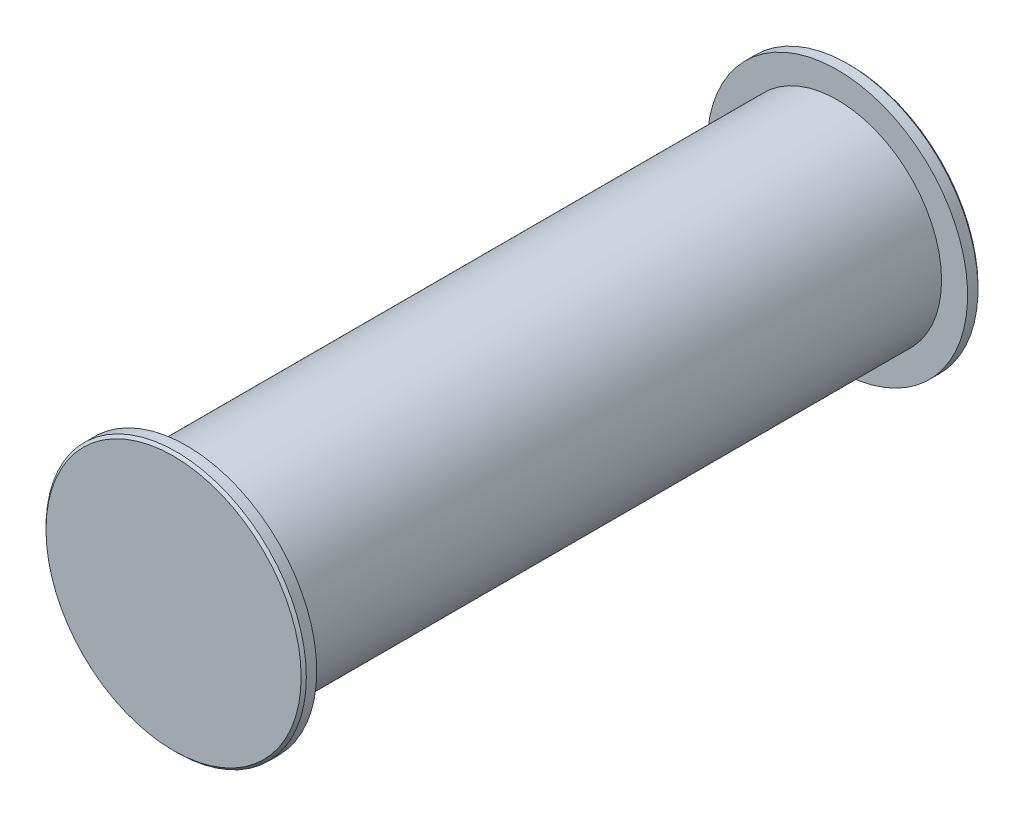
ISO-10303-21;
HEADER;
FILE_DESCRIPTION(('STEP AP214'),'2;1');
FILE_NAME('part.step','',(''),(''),'','','');
FILE_SCHEMA(('AUTOMOTIVE_DESIGN { 1 0 10303 214 1 1 1 1 }'));
ENDSEC;
DATA;
#1=APPLICATION_CONTEXT('core data for automotive mechanical design processes');
#2=APPLICATION_PROTOCOL_DEFINITION('international standard','automotive_design',2000,#1);
#3=PRODUCT_CONTEXT('',#1,'mechanical');
#4=PRODUCT('Part','Part','',(#3));
#5=PRODUCT_RELATED_PRODUCT_CATEGORY('part','',(#4));
#6=PRODUCT_DEFINITION_FORMATION('','',#4);
#7=PRODUCT_DEFINITION_CONTEXT('part definition',#1,'design');
#8=PRODUCT_DEFINITION('design','',#6,#7);
#9=PRODUCT_DEFINITION_SHAPE('','',#8);
#10=(LENGTH_UNIT() NAMED_UNIT(*) SI_UNIT(.MILLI.,.METRE.));
#11=(NAMED_UNIT(*) PLANE_ANGLE_UNIT() SI_UNIT($,.RADIAN.));
#12=(NAMED_UNIT(*) SI_UNIT($,.STERADIAN.) SOLID_ANGLE_UNIT());
#13=UNCERTAINTY_MEASURE_WITH_UNIT(LENGTH_MEASURE(1.E-05),#10,'distance_accuracy_value','');
#14=(GEOMETRIC_REPRESENTATION_CONTEXT(3) GLOBAL_UNCERTAINTY_ASSIGNED_CONTEXT((#13)) GLOBAL_UNIT_ASSIGNED_CONTEXT((#10,
#11,#12)) REPRESENTATION_CONTEXT('',''));
#15=CARTESIAN_POINT('',(0.,0.,0.));
#16=DIRECTION('',(0.,0.,1.));
#17=DIRECTION('',(1.,0.,0.));
#18=AXIS2_PLACEMENT_3D('',#15,#16,#17);
#19=CARTESIAN_POINT('',(0.,0.,25.));
#20=DIRECTION('',(0.,0.,-1.));
#21=DIRECTION('',(-1.,0.,0.));
#22=AXIS2_PLACEMENT_3D('',#19,#20,#21);
#23=CYLINDRICAL_SURFACE('',#22,4.);
#24=CARTESIAN_POINT('',(0.,0.,25.));
#25=DIRECTION('',(0.,0.,1.));
#26=DIRECTION('',(1.,0.,0.));
#27=AXIS2_PLACEMENT_3D('',#24,#25,#26);
#28=CIRCLE('',#27,4.);
#29=CARTESIAN_POINT('',(4.,0.,25.));
#30=VERTEX_POINT('',#29);
#31=EDGE_CURVE('E49',#30,#30,#28,.T.);
#32=ORIENTED_EDGE('',*,*,#31,.F.);
#33=EDGE_LOOP('',(#32));
#34=FACE_BOUND('',#33,.T.);
#35=CARTESIAN_POINT('',(0.,0.,0.));
#36=DIRECTION('',(0.,0.,-1.));
#37=DIRECTION('',(-1.,0.,0.));
#38=AXIS2_PLACEMENT_3D('',#35,#36,#37);
#39=CIRCLE('',#38,4.);
#40=CARTESIAN_POINT('',(-4.,0.,0.));
#41=VERTEX_POINT('',#40);
#42=EDGE_CURVE('E55',#41,#41,#39,.T.);
#43=ORIENTED_EDGE('',*,*,#42,.F.);
#44=EDGE_LOOP('',(#43));
#45=FACE_BOUND('',#44,.T.);
#46=ADVANCED_FACE('F30',(#34,#45),#23,.T.);
#47=CARTESIAN_POINT('',(0.,0.,25.));
#48=DIRECTION('',(0.,0.,1.));
#49=DIRECTION('',(1.,0.,0.));
#50=AXIS2_PLACEMENT_3D('',#47,#48,#49);
#51=PLANE('',#50);
#52=CARTESIAN_POINT('',(0.,0.,25.));
#53=DIRECTION('',(0.,0.,1.));
#54=DIRECTION('',(1.,0.,0.));
#55=AXIS2_PLACEMENT_3D('',#52,#53,#54);
#56=CIRCLE('',#55,5.);
#57=CARTESIAN_POINT('',(5.,0.,25.));
#58=VERTEX_POINT('',#57);
#59=EDGE_CURVE('E52',#58,#58,#56,.T.);
#60=ORIENTED_EDGE('',*,*,#59,.F.);
#61=EDGE_LOOP('',(#60));
#62=FACE_BOUND('',#61,.T.);
#63=ORIENTED_EDGE('',*,*,#31,.T.);
#64=EDGE_LOOP('',(#63));
#65=FACE_BOUND('',#64,.T.);
#66=ADVANCED_FACE('F72',(#62,#65),#51,.F.);
#67=CARTESIAN_POINT('',(0.,0.,25.5));
#68=DIRECTION('',(0.,0.,-1.));
#69=DIRECTION('',(-1.,0.,0.));
#70=AXIS2_PLACEMENT_3D('',#67,#68,#69);
#71=CYLINDRICAL_SURFACE('',#70,5.);
#72=CARTESIAN_POINT('',(0.,0.,25.4));
#73=DIRECTION('',(0.,0.,1.));
#74=DIRECTION('',(1.,0.,0.));
#75=AXIS2_PLACEMENT_3D('',#72,#73,#74);
#76=CIRCLE('',#75,5.);
#77=CARTESIAN_POINT('',(5.,0.,25.4));
#78=VERTEX_POINT('',#77);
#79=EDGE_CURVE('E40',#78,#78,#76,.F.);
#80=ORIENTED_EDGE('',*,*,#79,.T.);
#81=EDGE_LOOP('',(#80));
#82=FACE_BOUND('',#81,.T.);
#83=ORIENTED_EDGE('',*,*,#59,.T.);
#84=EDGE_LOOP('',(#83));
#85=FACE_BOUND('',#84,.T.);
#86=ADVANCED_FACE('F77',(#82,#85),#71,.T.);
#87=CARTESIAN_POINT('',(0.,0.,25.5));
#88=DIRECTION('',(0.,0.,1.));
#89=DIRECTION('',(1.,0.,0.));
#90=AXIS2_PLACEMENT_3D('',#87,#88,#89);
#91=PLANE('',#90);
#92=CARTESIAN_POINT('',(0.,0.,25.5));
#93=DIRECTION('',(0.,0.,1.));
#94=DIRECTION('',(1.,0.,0.));
#95=AXIS2_PLACEMENT_3D('',#92,#93,#94);
#96=CIRCLE('',#95,4.9);
#97=CARTESIAN_POINT('',(4.9,0.,25.5));
#98=VERTEX_POINT('',#97);
#99=EDGE_CURVE('E44',#98,#98,#96,.T.);
#100=ORIENTED_EDGE('',*,*,#99,.T.);
#101=EDGE_LOOP('',(#100));
#102=FACE_BOUND('',#101,.T.);
#103=ADVANCED_FACE('F85',(#102),#91,.T.);
#104=CARTESIAN_POINT('',(0.,0.,25.5));
#105=DIRECTION('',(0.,0.,-1.));
#106=DIRECTION('',(-1.,0.,0.));
#107=AXIS2_PLACEMENT_3D('',#104,#105,#106);
#108=CONICAL_SURFACE('',#107,4.9,0.785398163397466);
#109=ORIENTED_EDGE('',*,*,#79,.F.);
#110=EDGE_LOOP('',(#109));
#111=FACE_BOUND('',#110,.T.);
#112=ORIENTED_EDGE('',*,*,#99,.F.);
#113=EDGE_LOOP('',(#112));
#114=FACE_BOUND('',#113,.T.);
#115=ADVANCED_FACE('F67',(#111,#114),#108,.T.);
#116=CARTESIAN_POINT('',(0.,0.,0.));
#117=DIRECTION('',(0.,0.,-1.));
#118=DIRECTION('',(-1.,0.,0.));
#119=AXIS2_PLACEMENT_3D('',#116,#117,#118);
#120=PLANE('',#119);
#121=CARTESIAN_POINT('',(0.,0.,0.));
#122=DIRECTION('',(0.,0.,-1.));
#123=DIRECTION('',(-1.,0.,0.));
#124=AXIS2_PLACEMENT_3D('',#121,#122,#123);
#125=CIRCLE('',#124,5.);
#126=CARTESIAN_POINT('',(-5.,0.,0.));
#127=VERTEX_POINT('',#126);
#128=EDGE_CURVE('E58',#127,#127,#125,.T.);
#129=ORIENTED_EDGE('',*,*,#128,.F.);
#130=EDGE_LOOP('',(#129));
#131=FACE_BOUND('',#130,.T.);
#132=ORIENTED_EDGE('',*,*,#42,.T.);
#133=EDGE_LOOP('',(#132));
#134=FACE_BOUND('',#133,.T.);
#135=ADVANCED_FACE('F64',(#131,#134),#120,.F.);
#136=CARTESIAN_POINT('',(0.,0.,-0.5));
#137=DIRECTION('',(0.,0.,1.));
#138=DIRECTION('',(1.,0.,0.));
#139=AXIS2_PLACEMENT_3D('',#136,#137,#138);
#140=CYLINDRICAL_SURFACE('',#139,5.);
#141=CARTESIAN_POINT('',(0.,0.,-0.400000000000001));
#142=DIRECTION('',(0.,0.,-1.));
#143=DIRECTION('',(-1.,0.,0.));
#144=AXIS2_PLACEMENT_3D('',#141,#142,#143);
#145=CIRCLE('',#144,5.);
#146=CARTESIAN_POINT('',(-5.,0.,-0.400000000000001));
#147=VERTEX_POINT('',#146);
#148=EDGE_CURVE('E10',#147,#147,#145,.F.);
#149=ORIENTED_EDGE('',*,*,#148,.T.);
#150=EDGE_LOOP('',(#149));
#151=FACE_BOUND('',#150,.T.);
#152=ORIENTED_EDGE('',*,*,#128,.T.);
#153=EDGE_LOOP('',(#152));
#154=FACE_BOUND('',#153,.T.);
#155=ADVANCED_FACE('F62',(#151,#154),#140,.T.);
#156=CARTESIAN_POINT('',(0.,0.,-0.5));
#157=DIRECTION('',(0.,0.,-1.));
#158=DIRECTION('',(-1.,0.,0.));
#159=AXIS2_PLACEMENT_3D('',#156,#157,#158);
#160=PLANE('',#159);
#161=CARTESIAN_POINT('',(0.,0.,-0.5));
#162=DIRECTION('',(0.,0.,-1.));
#163=DIRECTION('',(-1.,0.,0.));
#164=AXIS2_PLACEMENT_3D('',#161,#162,#163);
#165=CIRCLE('',#164,4.9);
#166=CARTESIAN_POINT('',(-4.9,0.,-0.5));
#167=VERTEX_POINT('',#166);
#168=EDGE_CURVE('E36',#167,#167,#165,.T.);
#169=ORIENTED_EDGE('',*,*,#168,.T.);
#170=EDGE_LOOP('',(#169));
#171=FACE_BOUND('',#170,.T.);
#172=ADVANCED_FACE('F113',(#171),#160,.T.);
#173=CARTESIAN_POINT('',(0.,0.,-0.5));
#174=DIRECTION('',(0.,0.,1.));
#175=DIRECTION('',(1.,0.,0.));
#176=AXIS2_PLACEMENT_3D('',#173,#174,#175);
#177=CONICAL_SURFACE('',#176,4.9,0.785398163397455);
#178=ORIENTED_EDGE('',*,*,#148,.F.);
#179=EDGE_LOOP('',(#178));
#180=FACE_BOUND('',#179,.T.);
#181=ORIENTED_EDGE('',*,*,#168,.F.);
#182=EDGE_LOOP('',(#181));
#183=FACE_BOUND('',#182,.T.);
#184=ADVANCED_FACE('F119',(#180,#183),#177,.T.);
#185=CLOSED_SHELL('',(#46,#66,#86,#103,#115,#135,#155,#172,#184));
#186=MANIFOLD_SOLID_BREP('B2',#185);
#187=ADVANCED_BREP_SHAPE_REPRESENTATION('',(#18,#186),#14);
#188=SHAPE_DEFINITION_REPRESENTATION(#9,#187);
ENDSEC;
END-ISO-10303-21;
